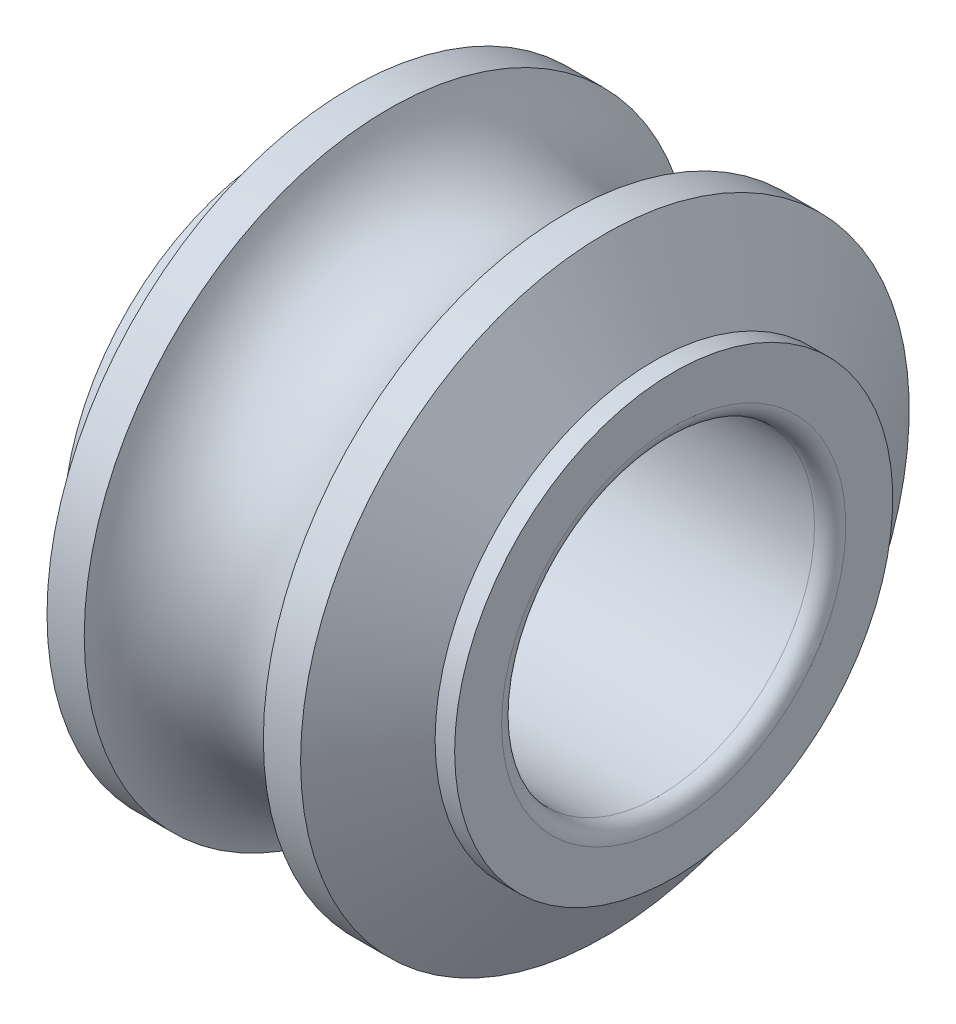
ISO-10303-21;
HEADER;
FILE_DESCRIPTION(('STEP AP214'),'2;1');
FILE_NAME('part.step','',(''),(''),'','','');
FILE_SCHEMA(('AUTOMOTIVE_DESIGN { 1 0 10303 214 1 1 1 1 }'));
ENDSEC;
DATA;
#1=APPLICATION_CONTEXT('core data for automotive mechanical design processes');
#2=APPLICATION_PROTOCOL_DEFINITION('international standard','automotive_design',2000,#1);
#3=PRODUCT_CONTEXT('',#1,'mechanical');
#4=PRODUCT('Part','Part','',(#3));
#5=PRODUCT_RELATED_PRODUCT_CATEGORY('part','',(#4));
#6=PRODUCT_DEFINITION_FORMATION('','',#4);
#7=PRODUCT_DEFINITION_CONTEXT('part definition',#1,'design');
#8=PRODUCT_DEFINITION('design','',#6,#7);
#9=PRODUCT_DEFINITION_SHAPE('','',#8);
#10=(LENGTH_UNIT() NAMED_UNIT(*) SI_UNIT(.MILLI.,.METRE.));
#11=(NAMED_UNIT(*) PLANE_ANGLE_UNIT() SI_UNIT($,.RADIAN.));
#12=(NAMED_UNIT(*) SI_UNIT($,.STERADIAN.) SOLID_ANGLE_UNIT());
#13=UNCERTAINTY_MEASURE_WITH_UNIT(LENGTH_MEASURE(1.E-05),#10,'distance_accuracy_value','');
#14=(GEOMETRIC_REPRESENTATION_CONTEXT(3) GLOBAL_UNCERTAINTY_ASSIGNED_CONTEXT((#13)) GLOBAL_UNIT_ASSIGNED_CONTEXT((#10,
#11,#12)) REPRESENTATION_CONTEXT('',''));
#15=CARTESIAN_POINT('',(0.,0.,0.));
#16=DIRECTION('',(0.,0.,1.));
#17=DIRECTION('',(1.,0.,0.));
#18=AXIS2_PLACEMENT_3D('',#15,#16,#17);
#19=CARTESIAN_POINT('',(4.8,0.,0.));
#20=DIRECTION('',(-1.,0.,0.));
#21=DIRECTION('',(0.,0.,1.));
#22=AXIS2_PLACEMENT_3D('',#19,#20,#21);
#23=TOROIDAL_SURFACE('',#22,2.2,0.2);
#24=CARTESIAN_POINT('',(5.,0.,0.));
#25=DIRECTION('',(-1.,0.,0.));
#26=DIRECTION('',(0.,0.,1.));
#27=AXIS2_PLACEMENT_3D('',#24,#25,#26);
#28=CIRCLE('',#27,2.2);
#29=CARTESIAN_POINT('',(5.,0.,2.2));
#30=VERTEX_POINT('',#29);
#31=EDGE_CURVE('E10',#30,#30,#28,.T.);
#32=ORIENTED_EDGE('',*,*,#31,.F.);
#33=EDGE_LOOP('',(#32));
#34=FACE_BOUND('',#33,.T.);
#35=CARTESIAN_POINT('',(4.8,0.,0.));
#36=DIRECTION('',(-1.,0.,0.));
#37=DIRECTION('',(0.,0.,1.));
#38=AXIS2_PLACEMENT_3D('',#35,#36,#37);
#39=CIRCLE('',#38,2.00000000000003);
#40=CARTESIAN_POINT('',(4.8,0.,2.00000000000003));
#41=VERTEX_POINT('',#40);
#42=EDGE_CURVE('E73',#41,#41,#39,.T.);
#43=ORIENTED_EDGE('',*,*,#42,.T.);
#44=EDGE_LOOP('',(#43));
#45=FACE_BOUND('',#44,.T.);
#46=ADVANCED_FACE('F15',(#34,#45),#23,.T.);
#47=CARTESIAN_POINT('',(5.,2.2,0.));
#48=DIRECTION('',(-1.,0.,0.));
#49=DIRECTION('',(0.,0.,1.));
#50=AXIS2_PLACEMENT_3D('',#47,#48,#49);
#51=PLANE('',#50);
#52=CARTESIAN_POINT('',(5.,0.,0.));
#53=DIRECTION('',(-1.,0.,0.));
#54=DIRECTION('',(0.,0.,1.));
#55=AXIS2_PLACEMENT_3D('',#52,#53,#54);
#56=CIRCLE('',#55,2.8);
#57=CARTESIAN_POINT('',(5.,0.,2.8));
#58=VERTEX_POINT('',#57);
#59=EDGE_CURVE('E22',#58,#58,#56,.T.);
#60=ORIENTED_EDGE('',*,*,#59,.F.);
#61=EDGE_LOOP('',(#60));
#62=FACE_BOUND('',#61,.T.);
#63=ORIENTED_EDGE('',*,*,#31,.T.);
#64=EDGE_LOOP('',(#63));
#65=FACE_BOUND('',#64,.T.);
#66=ADVANCED_FACE('F128',(#62,#65),#51,.F.);
#67=CARTESIAN_POINT('',(0.,0.,0.));
#68=DIRECTION('',(-1.,0.,0.));
#69=DIRECTION('',(0.,0.,1.));
#70=AXIS2_PLACEMENT_3D('',#67,#68,#69);
#71=CYLINDRICAL_SURFACE('',#70,2.8);
#72=CARTESIAN_POINT('',(4.75,0.,0.));
#73=DIRECTION('',(-1.,0.,0.));
#74=DIRECTION('',(0.,0.,1.));
#75=AXIS2_PLACEMENT_3D('',#72,#73,#74);
#76=CIRCLE('',#75,2.8);
#77=CARTESIAN_POINT('',(4.75,0.,2.8));
#78=VERTEX_POINT('',#77);
#79=EDGE_CURVE('E31',#78,#78,#76,.T.);
#80=ORIENTED_EDGE('',*,*,#79,.F.);
#81=EDGE_LOOP('',(#80));
#82=FACE_BOUND('',#81,.T.);
#83=ORIENTED_EDGE('',*,*,#59,.T.);
#84=EDGE_LOOP('',(#83));
#85=FACE_BOUND('',#84,.T.);
#86=ADVANCED_FACE('F133',(#82,#85),#71,.T.);
#87=CARTESIAN_POINT('',(4.75,0.,0.));
#88=DIRECTION('',(-1.,0.,0.));
#89=DIRECTION('',(0.,0.,1.));
#90=AXIS2_PLACEMENT_3D('',#87,#88,#89);
#91=CONICAL_SURFACE('',#90,2.8,1.0471975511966);
#92=CARTESIAN_POINT('',(4.12068820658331,0.,0.));
#93=DIRECTION('',(-1.,0.,0.));
#94=DIRECTION('',(0.,0.,1.));
#95=AXIS2_PLACEMENT_3D('',#92,#93,#94);
#96=CIRCLE('',#95,3.89);
#97=CARTESIAN_POINT('',(4.12068820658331,0.,3.89));
#98=VERTEX_POINT('',#97);
#99=EDGE_CURVE('E39',#98,#98,#96,.T.);
#100=ORIENTED_EDGE('',*,*,#99,.F.);
#101=EDGE_LOOP('',(#100));
#102=FACE_BOUND('',#101,.T.);
#103=ORIENTED_EDGE('',*,*,#79,.T.);
#104=EDGE_LOOP('',(#103));
#105=FACE_BOUND('',#104,.T.);
#106=ADVANCED_FACE('F124',(#102,#105),#91,.T.);
#107=CARTESIAN_POINT('',(0.,0.,0.));
#108=DIRECTION('',(-1.,0.,0.));
#109=DIRECTION('',(0.,0.,1.));
#110=AXIS2_PLACEMENT_3D('',#107,#108,#109);
#111=CYLINDRICAL_SURFACE('',#110,3.89);
#112=CARTESIAN_POINT('',(3.64472704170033,0.,0.));
#113=DIRECTION('',(-1.,0.,0.));
#114=DIRECTION('',(0.,0.,1.));
#115=AXIS2_PLACEMENT_3D('',#112,#113,#114);
#116=CIRCLE('',#115,3.89);
#117=CARTESIAN_POINT('',(3.64472704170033,0.,3.89));
#118=VERTEX_POINT('',#117);
#119=EDGE_CURVE('E45',#118,#118,#116,.T.);
#120=ORIENTED_EDGE('',*,*,#119,.F.);
#121=EDGE_LOOP('',(#120));
#122=FACE_BOUND('',#121,.T.);
#123=ORIENTED_EDGE('',*,*,#99,.T.);
#124=EDGE_LOOP('',(#123));
#125=FACE_BOUND('',#124,.T.);
#126=ADVANCED_FACE('F117',(#122,#125),#111,.T.);
#127=CARTESIAN_POINT('',(2.5,0.,0.));
#128=DIRECTION('',(-1.,0.,0.));
#129=DIRECTION('',(0.,0.,1.));
#130=AXIS2_PLACEMENT_3D('',#127,#128,#129);
#131=TOROIDAL_SURFACE('',#130,4.25,1.2);
#132=ORIENTED_EDGE('',*,*,#119,.T.);
#133=EDGE_LOOP('',(#132));
#134=FACE_BOUND('',#133,.T.);
#135=CARTESIAN_POINT('',(1.35527295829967,0.,0.));
#136=DIRECTION('',(-1.,0.,0.));
#137=DIRECTION('',(0.,0.,1.));
#138=AXIS2_PLACEMENT_3D('',#135,#136,#137);
#139=CIRCLE('',#138,3.89);
#140=CARTESIAN_POINT('',(1.35527295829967,0.,3.89));
#141=VERTEX_POINT('',#140);
#142=EDGE_CURVE('E49',#141,#141,#139,.T.);
#143=ORIENTED_EDGE('',*,*,#142,.F.);
#144=EDGE_LOOP('',(#143));
#145=FACE_BOUND('',#144,.T.);
#146=ADVANCED_FACE('F112',(#134,#145),#131,.F.);
#147=CARTESIAN_POINT('',(0.,0.,0.));
#148=DIRECTION('',(-1.,0.,0.));
#149=DIRECTION('',(0.,0.,1.));
#150=AXIS2_PLACEMENT_3D('',#147,#148,#149);
#151=CYLINDRICAL_SURFACE('',#150,3.89);
#152=CARTESIAN_POINT('',(0.879311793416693,0.,0.));
#153=DIRECTION('',(-1.,0.,0.));
#154=DIRECTION('',(0.,0.,1.));
#155=AXIS2_PLACEMENT_3D('',#152,#153,#154);
#156=CIRCLE('',#155,3.89);
#157=CARTESIAN_POINT('',(0.879311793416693,0.,3.89));
#158=VERTEX_POINT('',#157);
#159=EDGE_CURVE('E53',#158,#158,#156,.T.);
#160=ORIENTED_EDGE('',*,*,#159,.F.);
#161=EDGE_LOOP('',(#160));
#162=FACE_BOUND('',#161,.T.);
#163=ORIENTED_EDGE('',*,*,#142,.T.);
#164=EDGE_LOOP('',(#163));
#165=FACE_BOUND('',#164,.T.);
#166=ADVANCED_FACE('F106',(#162,#165),#151,.T.);
#167=CARTESIAN_POINT('',(0.879311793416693,0.,0.));
#168=DIRECTION('',(1.,0.,0.));
#169=DIRECTION('',(0.,0.,-1.));
#170=AXIS2_PLACEMENT_3D('',#167,#168,#169);
#171=CONICAL_SURFACE('',#170,3.89,1.0471975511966);
#172=CARTESIAN_POINT('',(0.25,0.,0.));
#173=DIRECTION('',(-1.,0.,0.));
#174=DIRECTION('',(0.,0.,1.));
#175=AXIS2_PLACEMENT_3D('',#172,#173,#174);
#176=CIRCLE('',#175,2.8);
#177=CARTESIAN_POINT('',(0.25,0.,2.8));
#178=VERTEX_POINT('',#177);
#179=EDGE_CURVE('E57',#178,#178,#176,.T.);
#180=ORIENTED_EDGE('',*,*,#179,.F.);
#181=EDGE_LOOP('',(#180));
#182=FACE_BOUND('',#181,.T.);
#183=ORIENTED_EDGE('',*,*,#159,.T.);
#184=EDGE_LOOP('',(#183));
#185=FACE_BOUND('',#184,.T.);
#186=ADVANCED_FACE('F100',(#182,#185),#171,.T.);
#187=CARTESIAN_POINT('',(0.,0.,0.));
#188=DIRECTION('',(-1.,0.,0.));
#189=DIRECTION('',(0.,0.,1.));
#190=AXIS2_PLACEMENT_3D('',#187,#188,#189);
#191=CYLINDRICAL_SURFACE('',#190,2.8);
#192=CARTESIAN_POINT('',(0.,0.,0.));
#193=DIRECTION('',(-1.,0.,0.));
#194=DIRECTION('',(0.,0.,1.));
#195=AXIS2_PLACEMENT_3D('',#192,#193,#194);
#196=CIRCLE('',#195,2.8);
#197=CARTESIAN_POINT('',(0.,0.,2.8));
#198=VERTEX_POINT('',#197);
#199=EDGE_CURVE('E61',#198,#198,#196,.T.);
#200=ORIENTED_EDGE('',*,*,#199,.F.);
#201=EDGE_LOOP('',(#200));
#202=FACE_BOUND('',#201,.T.);
#203=ORIENTED_EDGE('',*,*,#179,.T.);
#204=EDGE_LOOP('',(#203));
#205=FACE_BOUND('',#204,.T.);
#206=ADVANCED_FACE('F94',(#202,#205),#191,.T.);
#207=CARTESIAN_POINT('',(0.,2.8,0.));
#208=DIRECTION('',(1.,0.,0.));
#209=DIRECTION('',(0.,0.,-1.));
#210=AXIS2_PLACEMENT_3D('',#207,#208,#209);
#211=PLANE('',#210);
#212=CARTESIAN_POINT('',(0.,0.,0.));
#213=DIRECTION('',(-1.,0.,0.));
#214=DIRECTION('',(0.,0.,1.));
#215=AXIS2_PLACEMENT_3D('',#212,#213,#214);
#216=CIRCLE('',#215,2.2);
#217=CARTESIAN_POINT('',(0.,0.,2.2));
#218=VERTEX_POINT('',#217);
#219=EDGE_CURVE('E65',#218,#218,#216,.T.);
#220=ORIENTED_EDGE('',*,*,#219,.F.);
#221=EDGE_LOOP('',(#220));
#222=FACE_BOUND('',#221,.T.);
#223=ORIENTED_EDGE('',*,*,#199,.T.);
#224=EDGE_LOOP('',(#223));
#225=FACE_BOUND('',#224,.T.);
#226=ADVANCED_FACE('F88',(#222,#225),#211,.F.);
#227=CARTESIAN_POINT('',(0.2,0.,0.));
#228=DIRECTION('',(-1.,0.,0.));
#229=DIRECTION('',(0.,0.,1.));
#230=AXIS2_PLACEMENT_3D('',#227,#228,#229);
#231=TOROIDAL_SURFACE('',#230,2.2,0.2);
#232=CARTESIAN_POINT('',(0.2,0.,0.));
#233=DIRECTION('',(-1.,0.,0.));
#234=DIRECTION('',(0.,0.,1.));
#235=AXIS2_PLACEMENT_3D('',#232,#233,#234);
#236=CIRCLE('',#235,2.00000000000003);
#237=CARTESIAN_POINT('',(0.2,0.,2.00000000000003));
#238=VERTEX_POINT('',#237);
#239=EDGE_CURVE('E69',#238,#238,#236,.T.);
#240=ORIENTED_EDGE('',*,*,#239,.F.);
#241=EDGE_LOOP('',(#240));
#242=FACE_BOUND('',#241,.T.);
#243=ORIENTED_EDGE('',*,*,#219,.T.);
#244=EDGE_LOOP('',(#243));
#245=FACE_BOUND('',#244,.T.);
#246=ADVANCED_FACE('F82',(#242,#245),#231,.T.);
#247=CARTESIAN_POINT('',(0.,0.,0.));
#248=DIRECTION('',(-1.,0.,0.));
#249=DIRECTION('',(0.,0.,1.));
#250=AXIS2_PLACEMENT_3D('',#247,#248,#249);
#251=CYLINDRICAL_SURFACE('',#250,2.00000000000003);
#252=ORIENTED_EDGE('',*,*,#42,.F.);
#253=EDGE_LOOP('',(#252));
#254=FACE_BOUND('',#253,.T.);
#255=ORIENTED_EDGE('',*,*,#239,.T.);
#256=EDGE_LOOP('',(#255));
#257=FACE_BOUND('',#256,.T.);
#258=ADVANCED_FACE('F79',(#254,#257),#251,.F.);
#259=CLOSED_SHELL('',(#46,#66,#86,#106,#126,#146,#166,#186,#206,#226,#246,#258));
#260=MANIFOLD_SOLID_BREP('B1',#259);
#261=ADVANCED_BREP_SHAPE_REPRESENTATION('',(#18,#260),#14);
#262=SHAPE_DEFINITION_REPRESENTATION(#9,#261);
ENDSEC;
END-ISO-10303-21;
